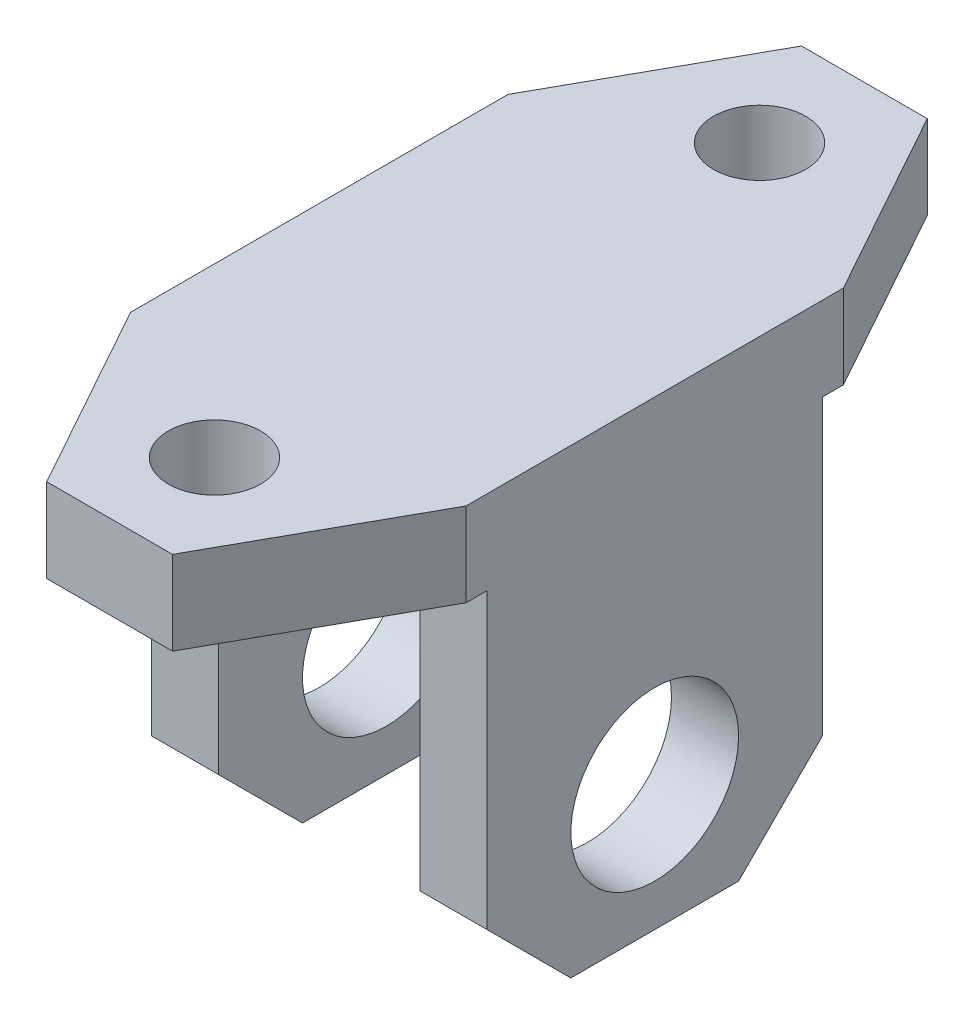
ISO-10303-21;
HEADER;
FILE_DESCRIPTION(('STEP AP214'),'2;1');
FILE_NAME('part.step','',(''),(''),'','','');
FILE_SCHEMA(('AUTOMOTIVE_DESIGN { 1 0 10303 214 1 1 1 1 }'));
ENDSEC;
DATA;
#1=APPLICATION_CONTEXT('core data for automotive mechanical design processes');
#2=APPLICATION_PROTOCOL_DEFINITION('international standard','automotive_design',2000,#1);
#3=PRODUCT_CONTEXT('',#1,'mechanical');
#4=PRODUCT('Part','Part','',(#3));
#5=PRODUCT_RELATED_PRODUCT_CATEGORY('part','',(#4));
#6=PRODUCT_DEFINITION_FORMATION('','',#4);
#7=PRODUCT_DEFINITION_CONTEXT('part definition',#1,'design');
#8=PRODUCT_DEFINITION('design','',#6,#7);
#9=PRODUCT_DEFINITION_SHAPE('','',#8);
#10=(LENGTH_UNIT() NAMED_UNIT(*) SI_UNIT(.MILLI.,.METRE.));
#11=(NAMED_UNIT(*) PLANE_ANGLE_UNIT() SI_UNIT($,.RADIAN.));
#12=(NAMED_UNIT(*) SI_UNIT($,.STERADIAN.) SOLID_ANGLE_UNIT());
#13=UNCERTAINTY_MEASURE_WITH_UNIT(LENGTH_MEASURE(1.E-05),#10,'distance_accuracy_value','');
#14=(GEOMETRIC_REPRESENTATION_CONTEXT(3) GLOBAL_UNCERTAINTY_ASSIGNED_CONTEXT((#13)) GLOBAL_UNIT_ASSIGNED_CONTEXT((#10,
#11,#12)) REPRESENTATION_CONTEXT('',''));
#15=CARTESIAN_POINT('',(0.,0.,0.));
#16=DIRECTION('',(0.,0.,1.));
#17=DIRECTION('',(1.,0.,0.));
#18=AXIS2_PLACEMENT_3D('',#15,#16,#17);
#19=CARTESIAN_POINT('',(2.4,-2.,-4.));
#20=DIRECTION('',(-1.,0.,0.));
#21=DIRECTION('',(0.,0.,1.));
#22=AXIS2_PLACEMENT_3D('',#19,#20,#21);
#23=PLANE('',#22);
#24=CARTESIAN_POINT('',(2.4,-8.,0.));
#25=DIRECTION('',(1.,0.,0.));
#26=DIRECTION('',(0.,0.,-1.));
#27=AXIS2_PLACEMENT_3D('',#24,#25,#26);
#28=CIRCLE('',#27,2.);
#29=CARTESIAN_POINT('',(2.4,-8.,-2.));
#30=VERTEX_POINT('',#29);
#31=EDGE_CURVE('E200',#30,#30,#28,.T.);
#32=ORIENTED_EDGE('',*,*,#31,.T.);
#33=EDGE_LOOP('',(#32));
#34=FACE_BOUND('',#33,.T.);
#35=DIRECTION('',(0.,0.,-1.));
#36=VECTOR('',#35,1.);
#37=CARTESIAN_POINT('',(2.4,-2.,-4.));
#38=LINE('',#37,#36);
#39=CARTESIAN_POINT('',(2.4,-2.,-4.));
#40=VERTEX_POINT('',#39);
#41=CARTESIAN_POINT('',(2.4,-2.,4.));
#42=VERTEX_POINT('',#41);
#43=EDGE_CURVE('E207',#40,#42,#38,.F.);
#44=ORIENTED_EDGE('',*,*,#43,.F.);
#45=DIRECTION('',(0.,1.,0.));
#46=VECTOR('',#45,1.);
#47=CARTESIAN_POINT('',(2.4,0.,-4.));
#48=LINE('',#47,#46);
#49=CARTESIAN_POINT('',(2.4,-9.,-4.));
#50=VERTEX_POINT('',#49);
#51=EDGE_CURVE('E209',#40,#50,#48,.F.);
#52=ORIENTED_EDGE('',*,*,#51,.T.);
#53=DIRECTION('',(0.,0.707106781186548,-0.707106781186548));
#54=VECTOR('',#53,1.);
#55=CARTESIAN_POINT('',(2.4,-9.,-4.));
#56=LINE('',#55,#54);
#57=CARTESIAN_POINT('',(2.4,-11.,-2.));
#58=VERTEX_POINT('',#57);
#59=EDGE_CURVE('E216',#58,#50,#56,.T.);
#60=ORIENTED_EDGE('',*,*,#59,.F.);
#61=DIRECTION('',(0.,0.,-1.));
#62=VECTOR('',#61,1.);
#63=CARTESIAN_POINT('',(2.4,-11.,-4.));
#64=LINE('',#63,#62);
#65=CARTESIAN_POINT('',(2.4,-11.,2.));
#66=VERTEX_POINT('',#65);
#67=EDGE_CURVE('E224',#66,#58,#64,.T.);
#68=ORIENTED_EDGE('',*,*,#67,.F.);
#69=DIRECTION('',(0.,0.707106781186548,0.707106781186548));
#70=VECTOR('',#69,1.);
#71=CARTESIAN_POINT('',(2.4,-9.,4.));
#72=LINE('',#71,#70);
#73=CARTESIAN_POINT('',(2.4,-9.,4.));
#74=VERTEX_POINT('',#73);
#75=EDGE_CURVE('E229',#66,#74,#72,.T.);
#76=ORIENTED_EDGE('',*,*,#75,.T.);
#77=DIRECTION('',(0.,1.,0.));
#78=VECTOR('',#77,1.);
#79=CARTESIAN_POINT('',(2.4,0.,4.));
#80=LINE('',#79,#78);
#81=EDGE_CURVE('E234',#42,#74,#80,.F.);
#82=ORIENTED_EDGE('',*,*,#81,.F.);
#83=EDGE_LOOP('',(#44,#52,#60,#68,#76,#82));
#84=FACE_BOUND('',#83,.T.);
#85=ADVANCED_FACE('F16',(#34,#84),#23,.T.);
#86=CARTESIAN_POINT('',(-2.4,-11.,-4.));
#87=DIRECTION('',(1.,0.,0.));
#88=DIRECTION('',(0.,0.,-1.));
#89=AXIS2_PLACEMENT_3D('',#86,#87,#88);
#90=PLANE('',#89);
#91=CARTESIAN_POINT('',(-2.4,-8.,0.));
#92=DIRECTION('',(1.,0.,0.));
#93=DIRECTION('',(0.,0.,-1.));
#94=AXIS2_PLACEMENT_3D('',#91,#92,#93);
#95=CIRCLE('',#94,2.);
#96=CARTESIAN_POINT('',(-2.4,-8.,-2.));
#97=VERTEX_POINT('',#96);
#98=EDGE_CURVE('E19',#97,#97,#95,.F.);
#99=ORIENTED_EDGE('',*,*,#98,.T.);
#100=EDGE_LOOP('',(#99));
#101=FACE_BOUND('',#100,.T.);
#102=DIRECTION('',(0.,0.707106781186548,-0.707106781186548));
#103=VECTOR('',#102,1.);
#104=CARTESIAN_POINT('',(-2.4,-9.,-4.));
#105=LINE('',#104,#103);
#106=CARTESIAN_POINT('',(-2.4,-9.,-4.));
#107=VERTEX_POINT('',#106);
#108=CARTESIAN_POINT('',(-2.4,-11.,-2.));
#109=VERTEX_POINT('',#108);
#110=EDGE_CURVE('E153',#107,#109,#105,.F.);
#111=ORIENTED_EDGE('',*,*,#110,.F.);
#112=DIRECTION('',(0.,1.,0.));
#113=VECTOR('',#112,1.);
#114=CARTESIAN_POINT('',(-2.4,0.,-4.));
#115=LINE('',#114,#113);
#116=CARTESIAN_POINT('',(-2.4,-2.,-4.));
#117=VERTEX_POINT('',#116);
#118=EDGE_CURVE('E157',#107,#117,#115,.T.);
#119=ORIENTED_EDGE('',*,*,#118,.T.);
#120=DIRECTION('',(0.,0.,-1.));
#121=VECTOR('',#120,1.);
#122=CARTESIAN_POINT('',(-2.4,-2.,-4.));
#123=LINE('',#122,#121);
#124=CARTESIAN_POINT('',(-2.4,-2.,4.));
#125=VERTEX_POINT('',#124);
#126=EDGE_CURVE('E272',#125,#117,#123,.T.);
#127=ORIENTED_EDGE('',*,*,#126,.F.);
#128=DIRECTION('',(0.,1.,0.));
#129=VECTOR('',#128,1.);
#130=CARTESIAN_POINT('',(-2.4,0.,4.));
#131=LINE('',#130,#129);
#132=CARTESIAN_POINT('',(-2.4,-9.,4.));
#133=VERTEX_POINT('',#132);
#134=EDGE_CURVE('E236',#133,#125,#131,.T.);
#135=ORIENTED_EDGE('',*,*,#134,.F.);
#136=DIRECTION('',(0.,0.707106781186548,0.707106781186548));
#137=VECTOR('',#136,1.);
#138=CARTESIAN_POINT('',(-2.4,-9.,4.));
#139=LINE('',#138,#137);
#140=CARTESIAN_POINT('',(-2.4,-11.,2.));
#141=VERTEX_POINT('',#140);
#142=EDGE_CURVE('E243',#133,#141,#139,.F.);
#143=ORIENTED_EDGE('',*,*,#142,.T.);
#144=DIRECTION('',(0.,0.,-1.));
#145=VECTOR('',#144,1.);
#146=CARTESIAN_POINT('',(-2.4,-11.,-4.));
#147=LINE('',#146,#145);
#148=EDGE_CURVE('E151',#109,#141,#147,.F.);
#149=ORIENTED_EDGE('',*,*,#148,.F.);
#150=EDGE_LOOP('',(#111,#119,#127,#135,#143,#149));
#151=FACE_BOUND('',#150,.T.);
#152=ADVANCED_FACE('F155',(#101,#151),#90,.T.);
#153=CARTESIAN_POINT('',(0.,0.,-4.));
#154=DIRECTION('',(0.,0.,1.));
#155=DIRECTION('',(1.,0.,0.));
#156=AXIS2_PLACEMENT_3D('',#153,#154,#155);
#157=PLANE('',#156);
#158=DIRECTION('',(1.,0.,0.));
#159=VECTOR('',#158,1.);
#160=CARTESIAN_POINT('',(-4.,-9.,-4.));
#161=LINE('',#160,#159);
#162=CARTESIAN_POINT('',(-4.,-9.,-4.));
#163=VERTEX_POINT('',#162);
#164=EDGE_CURVE('E162',#163,#107,#161,.T.);
#165=ORIENTED_EDGE('',*,*,#164,.F.);
#166=DIRECTION('',(0.,1.,0.));
#167=VECTOR('',#166,1.);
#168=CARTESIAN_POINT('',(-4.,0.,-4.));
#169=LINE('',#168,#167);
#170=CARTESIAN_POINT('',(-4.,-2.,-4.));
#171=VERTEX_POINT('',#170);
#172=EDGE_CURVE('E258',#171,#163,#169,.F.);
#173=ORIENTED_EDGE('',*,*,#172,.F.);
#174=DIRECTION('',(1.,0.,0.));
#175=VECTOR('',#174,1.);
#176=CARTESIAN_POINT('',(-2.4,-2.,-4.));
#177=LINE('',#176,#175);
#178=EDGE_CURVE('E168',#117,#171,#177,.F.);
#179=ORIENTED_EDGE('',*,*,#178,.F.);
#180=ORIENTED_EDGE('',*,*,#118,.F.);
#181=EDGE_LOOP('',(#165,#173,#179,#180));
#182=FACE_BOUND('',#181,.T.);
#183=ADVANCED_FACE('F165',(#182),#157,.F.);
#184=CARTESIAN_POINT('',(-4.,-9.,-4.));
#185=DIRECTION('',(0.,-0.707106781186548,-0.707106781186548));
#186=DIRECTION('',(0.,0.707106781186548,-0.707106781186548));
#187=AXIS2_PLACEMENT_3D('',#184,#185,#186);
#188=PLANE('',#187);
#189=DIRECTION('',(0.,-0.707106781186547,0.707106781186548));
#190=VECTOR('',#189,1.);
#191=CARTESIAN_POINT('',(-4.,-9.,-4.));
#192=LINE('',#191,#190);
#193=CARTESIAN_POINT('',(-4.,-11.,-2.));
#194=VERTEX_POINT('',#193);
#195=EDGE_CURVE('E173',#163,#194,#192,.T.);
#196=ORIENTED_EDGE('',*,*,#195,.F.);
#197=ORIENTED_EDGE('',*,*,#164,.T.);
#198=ORIENTED_EDGE('',*,*,#110,.T.);
#199=DIRECTION('',(1.,0.,0.));
#200=VECTOR('',#199,1.);
#201=CARTESIAN_POINT('',(-4.,-11.,-2.));
#202=LINE('',#201,#200);
#203=EDGE_CURVE('E176',#194,#109,#202,.T.);
#204=ORIENTED_EDGE('',*,*,#203,.F.);
#205=EDGE_LOOP('',(#196,#197,#198,#204));
#206=FACE_BOUND('',#205,.T.);
#207=ADVANCED_FACE('F171',(#206),#188,.T.);
#208=CARTESIAN_POINT('',(-4.,-11.,-4.));
#209=DIRECTION('',(0.,-1.,0.));
#210=DIRECTION('',(0.,0.,-1.));
#211=AXIS2_PLACEMENT_3D('',#208,#209,#210);
#212=PLANE('',#211);
#213=DIRECTION('',(0.,0.,1.));
#214=VECTOR('',#213,1.);
#215=CARTESIAN_POINT('',(-4.,-11.,-4.));
#216=LINE('',#215,#214);
#217=CARTESIAN_POINT('',(-4.,-11.,2.));
#218=VERTEX_POINT('',#217);
#219=EDGE_CURVE('E249',#194,#218,#216,.T.);
#220=ORIENTED_EDGE('',*,*,#219,.F.);
#221=ORIENTED_EDGE('',*,*,#203,.T.);
#222=ORIENTED_EDGE('',*,*,#148,.T.);
#223=DIRECTION('',(1.,0.,0.));
#224=VECTOR('',#223,1.);
#225=CARTESIAN_POINT('',(-4.,-11.,2.));
#226=LINE('',#225,#224);
#227=EDGE_CURVE('E241',#141,#218,#226,.F.);
#228=ORIENTED_EDGE('',*,*,#227,.T.);
#229=EDGE_LOOP('',(#220,#221,#222,#228));
#230=FACE_BOUND('',#229,.T.);
#231=ADVANCED_FACE('F246',(#230),#212,.T.);
#232=CARTESIAN_POINT('',(-4.,-9.,4.));
#233=DIRECTION('',(0.,0.707106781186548,-0.707106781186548));
#234=DIRECTION('',(0.,0.707106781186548,0.707106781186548));
#235=AXIS2_PLACEMENT_3D('',#232,#233,#234);
#236=PLANE('',#235);
#237=ORIENTED_EDGE('',*,*,#227,.F.);
#238=ORIENTED_EDGE('',*,*,#142,.F.);
#239=DIRECTION('',(1.,0.,0.));
#240=VECTOR('',#239,1.);
#241=CARTESIAN_POINT('',(0.,-9.,4.));
#242=LINE('',#241,#240);
#243=CARTESIAN_POINT('',(-4.,-9.,4.));
#244=VERTEX_POINT('',#243);
#245=EDGE_CURVE('E238',#244,#133,#242,.T.);
#246=ORIENTED_EDGE('',*,*,#245,.F.);
#247=DIRECTION('',(0.,0.707106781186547,0.707106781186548));
#248=VECTOR('',#247,1.);
#249=CARTESIAN_POINT('',(-4.,-11.,2.));
#250=LINE('',#249,#248);
#251=EDGE_CURVE('E253',#218,#244,#250,.T.);
#252=ORIENTED_EDGE('',*,*,#251,.F.);
#253=EDGE_LOOP('',(#237,#238,#246,#252));
#254=FACE_BOUND('',#253,.T.);
#255=ADVANCED_FACE('F329',(#254),#236,.F.);
#256=CARTESIAN_POINT('',(0.,0.,4.));
#257=DIRECTION('',(0.,0.,1.));
#258=DIRECTION('',(1.,0.,0.));
#259=AXIS2_PLACEMENT_3D('',#256,#257,#258);
#260=PLANE('',#259);
#261=ORIENTED_EDGE('',*,*,#134,.T.);
#262=DIRECTION('',(1.,0.,0.));
#263=VECTOR('',#262,1.);
#264=CARTESIAN_POINT('',(-2.4,-2.,4.));
#265=LINE('',#264,#263);
#266=CARTESIAN_POINT('',(-4.,-2.,4.));
#267=VERTEX_POINT('',#266);
#268=EDGE_CURVE('E274',#267,#125,#265,.T.);
#269=ORIENTED_EDGE('',*,*,#268,.F.);
#270=DIRECTION('',(0.,1.,0.));
#271=VECTOR('',#270,1.);
#272=CARTESIAN_POINT('',(-4.,0.,4.));
#273=LINE('',#272,#271);
#274=EDGE_CURVE('E325',#244,#267,#273,.T.);
#275=ORIENTED_EDGE('',*,*,#274,.F.);
#276=ORIENTED_EDGE('',*,*,#245,.T.);
#277=EDGE_LOOP('',(#261,#269,#275,#276));
#278=FACE_BOUND('',#277,.T.);
#279=ADVANCED_FACE('F332',(#278),#260,.T.);
#280=CARTESIAN_POINT('',(4.,-8.,0.));
#281=DIRECTION('',(1.,0.,0.));
#282=DIRECTION('',(0.,0.,-1.));
#283=AXIS2_PLACEMENT_3D('',#280,#281,#282);
#284=CYLINDRICAL_SURFACE('',#283,2.);
#285=ORIENTED_EDGE('',*,*,#98,.F.);
#286=EDGE_LOOP('',(#285));
#287=FACE_BOUND('',#286,.T.);
#288=CARTESIAN_POINT('',(-4.,-8.,0.));
#289=DIRECTION('',(1.,0.,0.));
#290=DIRECTION('',(0.,0.,-1.));
#291=AXIS2_PLACEMENT_3D('',#288,#289,#290);
#292=CIRCLE('',#291,2.);
#293=CARTESIAN_POINT('',(-4.,-8.,-2.));
#294=VERTEX_POINT('',#293);
#295=EDGE_CURVE('E196',#294,#294,#292,.T.);
#296=ORIENTED_EDGE('',*,*,#295,.F.);
#297=EDGE_LOOP('',(#296));
#298=FACE_BOUND('',#297,.T.);
#299=ADVANCED_FACE('F552',(#287,#298),#284,.F.);
#300=CARTESIAN_POINT('',(0.,0.,4.));
#301=DIRECTION('',(0.,0.,1.));
#302=DIRECTION('',(1.,0.,0.));
#303=AXIS2_PLACEMENT_3D('',#300,#301,#302);
#304=PLANE('',#303);
#305=DIRECTION('',(0.,1.,0.));
#306=VECTOR('',#305,1.);
#307=CARTESIAN_POINT('',(4.,-11.,4.));
#308=LINE('',#307,#306);
#309=CARTESIAN_POINT('',(4.,-2.,4.));
#310=VERTEX_POINT('',#309);
#311=CARTESIAN_POINT('',(4.,-9.,4.));
#312=VERTEX_POINT('',#311);
#313=EDGE_CURVE('E293',#310,#312,#308,.F.);
#314=ORIENTED_EDGE('',*,*,#313,.F.);
#315=DIRECTION('',(1.,0.,0.));
#316=VECTOR('',#315,1.);
#317=CARTESIAN_POINT('',(-2.4,-2.,4.));
#318=LINE('',#317,#316);
#319=EDGE_CURVE('E277',#42,#310,#318,.T.);
#320=ORIENTED_EDGE('',*,*,#319,.F.);
#321=ORIENTED_EDGE('',*,*,#81,.T.);
#322=DIRECTION('',(1.,0.,0.));
#323=VECTOR('',#322,1.);
#324=CARTESIAN_POINT('',(2.4,-9.,4.));
#325=LINE('',#324,#323);
#326=EDGE_CURVE('E232',#74,#312,#325,.T.);
#327=ORIENTED_EDGE('',*,*,#326,.T.);
#328=EDGE_LOOP('',(#314,#320,#321,#327));
#329=FACE_BOUND('',#328,.T.);
#330=ADVANCED_FACE('F291',(#329),#304,.T.);
#331=CARTESIAN_POINT('',(2.4,-9.,4.));
#332=DIRECTION('',(0.,0.707106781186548,-0.707106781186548));
#333=DIRECTION('',(0.,0.707106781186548,0.707106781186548));
#334=AXIS2_PLACEMENT_3D('',#331,#332,#333);
#335=PLANE('',#334);
#336=DIRECTION('',(1.,0.,0.));
#337=VECTOR('',#336,1.);
#338=CARTESIAN_POINT('',(2.4,-11.,2.));
#339=LINE('',#338,#337);
#340=CARTESIAN_POINT('',(4.,-11.,2.));
#341=VERTEX_POINT('',#340);
#342=EDGE_CURVE('E226',#341,#66,#339,.F.);
#343=ORIENTED_EDGE('',*,*,#342,.F.);
#344=DIRECTION('',(0.,-0.707106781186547,-0.707106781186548));
#345=VECTOR('',#344,1.);
#346=CARTESIAN_POINT('',(4.,-9.,4.));
#347=LINE('',#346,#345);
#348=EDGE_CURVE('E297',#312,#341,#347,.T.);
#349=ORIENTED_EDGE('',*,*,#348,.F.);
#350=ORIENTED_EDGE('',*,*,#326,.F.);
#351=ORIENTED_EDGE('',*,*,#75,.F.);
#352=EDGE_LOOP('',(#343,#349,#350,#351));
#353=FACE_BOUND('',#352,.T.);
#354=ADVANCED_FACE('F374',(#353),#335,.F.);
#355=CARTESIAN_POINT('',(2.4,-11.,-4.));
#356=DIRECTION('',(0.,-1.,0.));
#357=DIRECTION('',(0.,0.,-1.));
#358=AXIS2_PLACEMENT_3D('',#355,#356,#357);
#359=PLANE('',#358);
#360=ORIENTED_EDGE('',*,*,#67,.T.);
#361=DIRECTION('',(1.,0.,0.));
#362=VECTOR('',#361,1.);
#363=CARTESIAN_POINT('',(2.4,-11.,-2.));
#364=LINE('',#363,#362);
#365=CARTESIAN_POINT('',(4.,-11.,-2.));
#366=VERTEX_POINT('',#365);
#367=EDGE_CURVE('E221',#366,#58,#364,.F.);
#368=ORIENTED_EDGE('',*,*,#367,.F.);
#369=DIRECTION('',(0.,0.,-1.));
#370=VECTOR('',#369,1.);
#371=CARTESIAN_POINT('',(4.,-11.,-4.));
#372=LINE('',#371,#370);
#373=EDGE_CURVE('E370',#341,#366,#372,.T.);
#374=ORIENTED_EDGE('',*,*,#373,.F.);
#375=ORIENTED_EDGE('',*,*,#342,.T.);
#376=EDGE_LOOP('',(#360,#368,#374,#375));
#377=FACE_BOUND('',#376,.T.);
#378=ADVANCED_FACE('F376',(#377),#359,.T.);
#379=CARTESIAN_POINT('',(2.4,-9.,-4.));
#380=DIRECTION('',(0.,-0.707106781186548,-0.707106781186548));
#381=DIRECTION('',(0.,0.707106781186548,-0.707106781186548));
#382=AXIS2_PLACEMENT_3D('',#379,#380,#381);
#383=PLANE('',#382);
#384=ORIENTED_EDGE('',*,*,#59,.T.);
#385=DIRECTION('',(1.,0.,0.));
#386=VECTOR('',#385,1.);
#387=CARTESIAN_POINT('',(0.,-9.,-4.));
#388=LINE('',#387,#386);
#389=CARTESIAN_POINT('',(4.,-9.,-4.));
#390=VERTEX_POINT('',#389);
#391=EDGE_CURVE('E203',#50,#390,#388,.T.);
#392=ORIENTED_EDGE('',*,*,#391,.T.);
#393=DIRECTION('',(0.,0.707106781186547,-0.707106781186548));
#394=VECTOR('',#393,1.);
#395=CARTESIAN_POINT('',(4.,-11.,-2.));
#396=LINE('',#395,#394);
#397=EDGE_CURVE('E367',#366,#390,#396,.T.);
#398=ORIENTED_EDGE('',*,*,#397,.F.);
#399=ORIENTED_EDGE('',*,*,#367,.T.);
#400=EDGE_LOOP('',(#384,#392,#398,#399));
#401=FACE_BOUND('',#400,.T.);
#402=ADVANCED_FACE('F377',(#401),#383,.T.);
#403=CARTESIAN_POINT('',(0.,0.,-4.));
#404=DIRECTION('',(0.,0.,1.));
#405=DIRECTION('',(1.,0.,0.));
#406=AXIS2_PLACEMENT_3D('',#403,#404,#405);
#407=PLANE('',#406);
#408=ORIENTED_EDGE('',*,*,#391,.F.);
#409=ORIENTED_EDGE('',*,*,#51,.F.);
#410=DIRECTION('',(1.,0.,0.));
#411=VECTOR('',#410,1.);
#412=CARTESIAN_POINT('',(-2.4,-2.,-4.));
#413=LINE('',#412,#411);
#414=CARTESIAN_POINT('',(4.,-2.,-4.));
#415=VERTEX_POINT('',#414);
#416=EDGE_CURVE('E202',#415,#40,#413,.F.);
#417=ORIENTED_EDGE('',*,*,#416,.F.);
#418=DIRECTION('',(0.,1.,0.));
#419=VECTOR('',#418,1.);
#420=CARTESIAN_POINT('',(4.,-11.,-4.));
#421=LINE('',#420,#419);
#422=EDGE_CURVE('E364',#390,#415,#421,.T.);
#423=ORIENTED_EDGE('',*,*,#422,.F.);
#424=EDGE_LOOP('',(#408,#409,#417,#423));
#425=FACE_BOUND('',#424,.T.);
#426=ADVANCED_FACE('F379',(#425),#407,.F.);
#427=CARTESIAN_POINT('',(4.,-8.,0.));
#428=DIRECTION('',(1.,0.,0.));
#429=DIRECTION('',(0.,0.,-1.));
#430=AXIS2_PLACEMENT_3D('',#427,#428,#429);
#431=CYLINDRICAL_SURFACE('',#430,2.);
#432=CARTESIAN_POINT('',(4.,-8.,0.));
#433=DIRECTION('',(1.,0.,0.));
#434=DIRECTION('',(0.,0.,-1.));
#435=AXIS2_PLACEMENT_3D('',#432,#433,#434);
#436=CIRCLE('',#435,2.);
#437=CARTESIAN_POINT('',(4.,-8.,-2.));
#438=VERTEX_POINT('',#437);
#439=EDGE_CURVE('E191',#438,#438,#436,.F.);
#440=ORIENTED_EDGE('',*,*,#439,.F.);
#441=EDGE_LOOP('',(#440));
#442=FACE_BOUND('',#441,.T.);
#443=ORIENTED_EDGE('',*,*,#31,.F.);
#444=EDGE_LOOP('',(#443));
#445=FACE_BOUND('',#444,.T.);
#446=ADVANCED_FACE('F507',(#442,#445),#431,.F.);
#447=CARTESIAN_POINT('',(-2.4,-2.,-4.));
#448=DIRECTION('',(0.,-1.,0.));
#449=DIRECTION('',(0.,0.,-1.));
#450=AXIS2_PLACEMENT_3D('',#447,#448,#449);
#451=PLANE('',#450);
#452=CARTESIAN_POINT('',(0.,-2.,-6.5));
#453=DIRECTION('',(0.,1.,0.));
#454=DIRECTION('',(0.,0.,1.));
#455=AXIS2_PLACEMENT_3D('',#452,#453,#454);
#456=CIRCLE('',#455,1.1);
#457=CARTESIAN_POINT('',(0.,-2.,-5.4));
#458=VERTEX_POINT('',#457);
#459=EDGE_CURVE('E183',#458,#458,#456,.T.);
#460=ORIENTED_EDGE('',*,*,#459,.T.);
#461=EDGE_LOOP('',(#460));
#462=FACE_BOUND('',#461,.T.);
#463=CARTESIAN_POINT('',(0.,-2.,6.5));
#464=DIRECTION('',(0.,-1.,0.));
#465=DIRECTION('',(0.,0.,-1.));
#466=AXIS2_PLACEMENT_3D('',#463,#464,#465);
#467=CIRCLE('',#466,1.1);
#468=CARTESIAN_POINT('',(0.,-2.,5.4));
#469=VERTEX_POINT('',#468);
#470=EDGE_CURVE('E187',#469,#469,#467,.F.);
#471=ORIENTED_EDGE('',*,*,#470,.T.);
#472=EDGE_LOOP('',(#471));
#473=FACE_BOUND('',#472,.T.);
#474=DIRECTION('',(1.,0.,0.));
#475=VECTOR('',#474,1.);
#476=CARTESIAN_POINT('',(0.,-2.,-9.));
#477=LINE('',#476,#475);
#478=CARTESIAN_POINT('',(-1.50000000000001,-2.,-9.00000000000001));
#479=VERTEX_POINT('',#478);
#480=CARTESIAN_POINT('',(1.5,-2.,-9.));
#481=VERTEX_POINT('',#480);
#482=EDGE_CURVE('E269',#479,#481,#477,.T.);
#483=ORIENTED_EDGE('',*,*,#482,.T.);
#484=DIRECTION('',(0.485642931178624,0.,0.874157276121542));
#485=VECTOR('',#484,1.);
#486=CARTESIAN_POINT('',(1.5,-2.,-9.));
#487=LINE('',#486,#485);
#488=CARTESIAN_POINT('',(3.99999999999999,-2.,-4.5));
#489=VERTEX_POINT('',#488);
#490=EDGE_CURVE('E194',#481,#489,#487,.T.);
#491=ORIENTED_EDGE('',*,*,#490,.T.);
#492=DIRECTION('',(0.,0.,-1.));
#493=VECTOR('',#492,1.);
#494=CARTESIAN_POINT('',(4.,-2.,-4.));
#495=LINE('',#494,#493);
#496=EDGE_CURVE('E195',#415,#489,#495,.T.);
#497=ORIENTED_EDGE('',*,*,#496,.F.);
#498=ORIENTED_EDGE('',*,*,#416,.T.);
#499=ORIENTED_EDGE('',*,*,#43,.T.);
#500=ORIENTED_EDGE('',*,*,#319,.T.);
#501=DIRECTION('',(0.,0.,-1.));
#502=VECTOR('',#501,1.);
#503=CARTESIAN_POINT('',(4.,-2.,-4.));
#504=LINE('',#503,#502);
#505=CARTESIAN_POINT('',(4.,-2.,4.5));
#506=VERTEX_POINT('',#505);
#507=EDGE_CURVE('E298',#506,#310,#504,.T.);
#508=ORIENTED_EDGE('',*,*,#507,.F.);
#509=DIRECTION('',(-0.485642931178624,0.,0.874157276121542));
#510=VECTOR('',#509,1.);
#511=CARTESIAN_POINT('',(4.,-2.,4.5));
#512=LINE('',#511,#510);
#513=CARTESIAN_POINT('',(1.50000000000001,-2.,9.00000000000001));
#514=VERTEX_POINT('',#513);
#515=EDGE_CURVE('E309',#506,#514,#512,.T.);
#516=ORIENTED_EDGE('',*,*,#515,.T.);
#517=DIRECTION('',(1.,0.,0.));
#518=VECTOR('',#517,1.);
#519=CARTESIAN_POINT('',(0.,-2.,9.));
#520=LINE('',#519,#518);
#521=CARTESIAN_POINT('',(-1.5,-2.,9.));
#522=VERTEX_POINT('',#521);
#523=EDGE_CURVE('E314',#522,#514,#520,.T.);
#524=ORIENTED_EDGE('',*,*,#523,.F.);
#525=DIRECTION('',(-0.485642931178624,0.,-0.874157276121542));
#526=VECTOR('',#525,1.);
#527=CARTESIAN_POINT('',(-1.5,-2.,9.));
#528=LINE('',#527,#526);
#529=CARTESIAN_POINT('',(-3.99999999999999,-2.,4.49999999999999));
#530=VERTEX_POINT('',#529);
#531=EDGE_CURVE('E198',#522,#530,#528,.T.);
#532=ORIENTED_EDGE('',*,*,#531,.T.);
#533=DIRECTION('',(0.,0.,1.));
#534=VECTOR('',#533,1.);
#535=CARTESIAN_POINT('',(-4.,-2.,-4.));
#536=LINE('',#535,#534);
#537=EDGE_CURVE('E322',#267,#530,#536,.T.);
#538=ORIENTED_EDGE('',*,*,#537,.F.);
#539=ORIENTED_EDGE('',*,*,#268,.T.);
#540=ORIENTED_EDGE('',*,*,#126,.T.);
#541=ORIENTED_EDGE('',*,*,#178,.T.);
#542=DIRECTION('',(0.,0.,1.));
#543=VECTOR('',#542,1.);
#544=CARTESIAN_POINT('',(-4.,-2.,-4.));
#545=LINE('',#544,#543);
#546=CARTESIAN_POINT('',(-4.,-2.,-4.5));
#547=VERTEX_POINT('',#546);
#548=EDGE_CURVE('E260',#547,#171,#545,.T.);
#549=ORIENTED_EDGE('',*,*,#548,.F.);
#550=DIRECTION('',(0.485642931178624,0.,-0.874157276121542));
#551=VECTOR('',#550,1.);
#552=CARTESIAN_POINT('',(-4.,-2.,-4.5));
#553=LINE('',#552,#551);
#554=EDGE_CURVE('E267',#547,#479,#553,.T.);
#555=ORIENTED_EDGE('',*,*,#554,.T.);
#556=EDGE_LOOP('',(#483,#491,#497,#498,#499,#500,#508,#516,#524,#532,#538,#539,#540,#541,#549,#555));
#557=FACE_BOUND('',#556,.T.);
#558=ADVANCED_FACE('F281',(#462,#473,#557),#451,.T.);
#559=CARTESIAN_POINT('',(0.,0.,-9.));
#560=DIRECTION('',(0.,0.,1.));
#561=DIRECTION('',(1.,0.,0.));
#562=AXIS2_PLACEMENT_3D('',#559,#560,#561);
#563=PLANE('',#562);
#564=DIRECTION('',(0.,1.,0.));
#565=VECTOR('',#564,1.);
#566=CARTESIAN_POINT('',(-1.50000000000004,0.,-9.00000000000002));
#567=LINE('',#566,#565);
#568=CARTESIAN_POINT('',(-1.50000000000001,0.,-9.00000000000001));
#569=VERTEX_POINT('',#568);
#570=EDGE_CURVE('E265',#479,#569,#567,.T.);
#571=ORIENTED_EDGE('',*,*,#570,.T.);
#572=DIRECTION('',(1.,0.,0.));
#573=VECTOR('',#572,1.);
#574=CARTESIAN_POINT('',(4.,0.,-9.));
#575=LINE('',#574,#573);
#576=CARTESIAN_POINT('',(1.5,0.,-9.));
#577=VERTEX_POINT('',#576);
#578=EDGE_CURVE('E186',#577,#569,#575,.F.);
#579=ORIENTED_EDGE('',*,*,#578,.F.);
#580=DIRECTION('',(0.,1.,0.));
#581=VECTOR('',#580,1.);
#582=CARTESIAN_POINT('',(1.5,0.,-9.));
#583=LINE('',#582,#581);
#584=EDGE_CURVE('E190',#577,#481,#583,.F.);
#585=ORIENTED_EDGE('',*,*,#584,.T.);
#586=ORIENTED_EDGE('',*,*,#482,.F.);
#587=EDGE_LOOP('',(#571,#579,#585,#586));
#588=FACE_BOUND('',#587,.T.);
#589=ADVANCED_FACE('F490',(#588),#563,.F.);
#590=CARTESIAN_POINT('',(-4.,0.,-4.5));
#591=DIRECTION('',(0.874157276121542,0.,0.485642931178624));
#592=DIRECTION('',(0.485642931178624,0.,-0.874157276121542));
#593=AXIS2_PLACEMENT_3D('',#590,#591,#592);
#594=PLANE('',#593);
#595=DIRECTION('',(-0.485642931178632,0.,0.874157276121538));
#596=VECTOR('',#595,1.);
#597=CARTESIAN_POINT('',(-1.5,0.,-9.));
#598=LINE('',#597,#596);
#599=CARTESIAN_POINT('',(-4.,0.,-4.5));
#600=VERTEX_POINT('',#599);
#601=EDGE_CURVE('E353',#569,#600,#598,.T.);
#602=ORIENTED_EDGE('',*,*,#601,.F.);
#603=ORIENTED_EDGE('',*,*,#570,.F.);
#604=ORIENTED_EDGE('',*,*,#554,.F.);
#605=DIRECTION('',(0.,1.,0.));
#606=VECTOR('',#605,1.);
#607=CARTESIAN_POINT('',(-4.,0.,-4.5));
#608=LINE('',#607,#606);
#609=EDGE_CURVE('E199',#600,#547,#608,.F.);
#610=ORIENTED_EDGE('',*,*,#609,.F.);
#611=EDGE_LOOP('',(#602,#603,#604,#610));
#612=FACE_BOUND('',#611,.T.);
#613=ADVANCED_FACE('F481',(#612),#594,.F.);
#614=CARTESIAN_POINT('',(-4.,0.,-4.));
#615=DIRECTION('',(-1.,0.,0.));
#616=DIRECTION('',(0.,0.,1.));
#617=AXIS2_PLACEMENT_3D('',#614,#615,#616);
#618=PLANE('',#617);
#619=ORIENTED_EDGE('',*,*,#295,.T.);
#620=EDGE_LOOP('',(#619));
#621=FACE_BOUND('',#620,.T.);
#622=DIRECTION('',(0.,0.,1.));
#623=VECTOR('',#622,1.);
#624=CARTESIAN_POINT('',(-4.,0.,-4.));
#625=LINE('',#624,#623);
#626=CARTESIAN_POINT('',(-3.99999999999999,0.,4.49999999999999));
#627=VERTEX_POINT('',#626);
#628=EDGE_CURVE('E346',#600,#627,#625,.T.);
#629=ORIENTED_EDGE('',*,*,#628,.F.);
#630=ORIENTED_EDGE('',*,*,#609,.T.);
#631=ORIENTED_EDGE('',*,*,#548,.T.);
#632=ORIENTED_EDGE('',*,*,#172,.T.);
#633=ORIENTED_EDGE('',*,*,#195,.T.);
#634=ORIENTED_EDGE('',*,*,#219,.T.);
#635=ORIENTED_EDGE('',*,*,#251,.T.);
#636=ORIENTED_EDGE('',*,*,#274,.T.);
#637=ORIENTED_EDGE('',*,*,#537,.T.);
#638=DIRECTION('',(0.,1.,0.));
#639=VECTOR('',#638,1.);
#640=CARTESIAN_POINT('',(-3.99999999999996,0.,4.49999999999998));
#641=LINE('',#640,#639);
#642=EDGE_CURVE('E317',#530,#627,#641,.T.);
#643=ORIENTED_EDGE('',*,*,#642,.T.);
#644=EDGE_LOOP('',(#629,#630,#631,#632,#633,#634,#635,#636,#637,#643));
#645=FACE_BOUND('',#644,.T.);
#646=ADVANCED_FACE('F256',(#621,#645),#618,.T.);
#647=CARTESIAN_POINT('',(-1.5,0.,9.));
#648=DIRECTION('',(0.874157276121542,0.,-0.485642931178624));
#649=DIRECTION('',(-0.485642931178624,0.,-0.874157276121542));
#650=AXIS2_PLACEMENT_3D('',#647,#648,#649);
#651=PLANE('',#650);
#652=DIRECTION('',(0.485642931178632,0.,0.874157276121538));
#653=VECTOR('',#652,1.);
#654=CARTESIAN_POINT('',(-4.,0.,4.5));
#655=LINE('',#654,#653);
#656=CARTESIAN_POINT('',(-1.5,0.,9.));
#657=VERTEX_POINT('',#656);
#658=EDGE_CURVE('E340',#627,#657,#655,.T.);
#659=ORIENTED_EDGE('',*,*,#658,.F.);
#660=ORIENTED_EDGE('',*,*,#642,.F.);
#661=ORIENTED_EDGE('',*,*,#531,.F.);
#662=DIRECTION('',(0.,1.,0.));
#663=VECTOR('',#662,1.);
#664=CARTESIAN_POINT('',(-1.5,0.,9.));
#665=LINE('',#664,#663);
#666=EDGE_CURVE('E311',#657,#522,#665,.F.);
#667=ORIENTED_EDGE('',*,*,#666,.F.);
#668=EDGE_LOOP('',(#659,#660,#661,#667));
#669=FACE_BOUND('',#668,.T.);
#670=ADVANCED_FACE('F338',(#669),#651,.F.);
#671=CARTESIAN_POINT('',(0.,0.,9.));
#672=DIRECTION('',(0.,0.,1.));
#673=DIRECTION('',(1.,0.,0.));
#674=AXIS2_PLACEMENT_3D('',#671,#672,#673);
#675=PLANE('',#674);
#676=DIRECTION('',(1.,0.,0.));
#677=VECTOR('',#676,1.);
#678=CARTESIAN_POINT('',(4.,0.,9.));
#679=LINE('',#678,#677);
#680=CARTESIAN_POINT('',(1.50000000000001,0.,9.00000000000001));
#681=VERTEX_POINT('',#680);
#682=EDGE_CURVE('E345',#657,#681,#679,.T.);
#683=ORIENTED_EDGE('',*,*,#682,.F.);
#684=ORIENTED_EDGE('',*,*,#666,.T.);
#685=ORIENTED_EDGE('',*,*,#523,.T.);
#686=DIRECTION('',(0.,1.,0.));
#687=VECTOR('',#686,1.);
#688=CARTESIAN_POINT('',(1.50000000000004,0.,9.00000000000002));
#689=LINE('',#688,#687);
#690=EDGE_CURVE('E304',#514,#681,#689,.T.);
#691=ORIENTED_EDGE('',*,*,#690,.T.);
#692=EDGE_LOOP('',(#683,#684,#685,#691));
#693=FACE_BOUND('',#692,.T.);
#694=ADVANCED_FACE('F394',(#693),#675,.T.);
#695=CARTESIAN_POINT('',(4.,0.,4.5));
#696=DIRECTION('',(-0.874157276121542,0.,-0.485642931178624));
#697=DIRECTION('',(-0.485642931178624,0.,0.874157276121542));
#698=AXIS2_PLACEMENT_3D('',#695,#696,#697);
#699=PLANE('',#698);
#700=DIRECTION('',(0.485642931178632,0.,-0.874157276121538));
#701=VECTOR('',#700,1.);
#702=CARTESIAN_POINT('',(1.5,0.,9.));
#703=LINE('',#702,#701);
#704=CARTESIAN_POINT('',(4.,0.,4.5));
#705=VERTEX_POINT('',#704);
#706=EDGE_CURVE('E390',#681,#705,#703,.T.);
#707=ORIENTED_EDGE('',*,*,#706,.F.);
#708=ORIENTED_EDGE('',*,*,#690,.F.);
#709=ORIENTED_EDGE('',*,*,#515,.F.);
#710=DIRECTION('',(0.,1.,0.));
#711=VECTOR('',#710,1.);
#712=CARTESIAN_POINT('',(4.,-11.,4.5));
#713=LINE('',#712,#711);
#714=EDGE_CURVE('E302',#705,#506,#713,.F.);
#715=ORIENTED_EDGE('',*,*,#714,.F.);
#716=EDGE_LOOP('',(#707,#708,#709,#715));
#717=FACE_BOUND('',#716,.T.);
#718=ADVANCED_FACE('F397',(#717),#699,.F.);
#719=CARTESIAN_POINT('',(4.,-11.,-4.));
#720=DIRECTION('',(1.,0.,0.));
#721=DIRECTION('',(0.,0.,-1.));
#722=AXIS2_PLACEMENT_3D('',#719,#720,#721);
#723=PLANE('',#722);
#724=ORIENTED_EDGE('',*,*,#439,.T.);
#725=EDGE_LOOP('',(#724));
#726=FACE_BOUND('',#725,.T.);
#727=ORIENTED_EDGE('',*,*,#496,.T.);
#728=DIRECTION('',(0.,1.,0.));
#729=VECTOR('',#728,1.);
#730=CARTESIAN_POINT('',(3.99999999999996,0.,-4.49999999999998));
#731=LINE('',#730,#729);
#732=CARTESIAN_POINT('',(3.99999999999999,0.,-4.49999999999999));
#733=VERTEX_POINT('',#732);
#734=EDGE_CURVE('E34',#489,#733,#731,.T.);
#735=ORIENTED_EDGE('',*,*,#734,.T.);
#736=DIRECTION('',(0.,0.,1.));
#737=VECTOR('',#736,1.);
#738=CARTESIAN_POINT('',(4.,0.,-4.));
#739=LINE('',#738,#737);
#740=EDGE_CURVE('E386',#705,#733,#739,.F.);
#741=ORIENTED_EDGE('',*,*,#740,.F.);
#742=ORIENTED_EDGE('',*,*,#714,.T.);
#743=ORIENTED_EDGE('',*,*,#507,.T.);
#744=ORIENTED_EDGE('',*,*,#313,.T.);
#745=ORIENTED_EDGE('',*,*,#348,.T.);
#746=ORIENTED_EDGE('',*,*,#373,.T.);
#747=ORIENTED_EDGE('',*,*,#397,.T.);
#748=ORIENTED_EDGE('',*,*,#422,.T.);
#749=EDGE_LOOP('',(#727,#735,#741,#742,#743,#744,#745,#746,#747,#748));
#750=FACE_BOUND('',#749,.T.);
#751=ADVANCED_FACE('F301',(#726,#750),#723,.T.);
#752=CARTESIAN_POINT('',(1.5,0.,-9.));
#753=DIRECTION('',(-0.874157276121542,0.,0.485642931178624));
#754=DIRECTION('',(0.485642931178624,0.,0.874157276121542));
#755=AXIS2_PLACEMENT_3D('',#752,#753,#754);
#756=PLANE('',#755);
#757=DIRECTION('',(-0.485642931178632,0.,-0.874157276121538));
#758=VECTOR('',#757,1.);
#759=CARTESIAN_POINT('',(4.,0.,-4.5));
#760=LINE('',#759,#758);
#761=EDGE_CURVE('E182',#733,#577,#760,.T.);
#762=ORIENTED_EDGE('',*,*,#761,.F.);
#763=ORIENTED_EDGE('',*,*,#734,.F.);
#764=ORIENTED_EDGE('',*,*,#490,.F.);
#765=ORIENTED_EDGE('',*,*,#584,.F.);
#766=EDGE_LOOP('',(#762,#763,#764,#765));
#767=FACE_BOUND('',#766,.T.);
#768=ADVANCED_FACE('F384',(#767),#756,.F.);
#769=CARTESIAN_POINT('',(0.,-2.,6.5));
#770=DIRECTION('',(0.,-1.,0.));
#771=DIRECTION('',(0.,0.,-1.));
#772=AXIS2_PLACEMENT_3D('',#769,#770,#771);
#773=CYLINDRICAL_SURFACE('',#772,1.1);
#774=CARTESIAN_POINT('',(0.,0.,6.5));
#775=DIRECTION('',(0.,-1.,0.));
#776=DIRECTION('',(0.,0.,-1.));
#777=AXIS2_PLACEMENT_3D('',#774,#775,#776);
#778=CIRCLE('',#777,1.1);
#779=CARTESIAN_POINT('',(0.,0.,5.4));
#780=VERTEX_POINT('',#779);
#781=EDGE_CURVE('E25',#780,#780,#778,.T.);
#782=ORIENTED_EDGE('',*,*,#781,.F.);
#783=EDGE_LOOP('',(#782));
#784=FACE_BOUND('',#783,.T.);
#785=ORIENTED_EDGE('',*,*,#470,.F.);
#786=EDGE_LOOP('',(#785));
#787=FACE_BOUND('',#786,.T.);
#788=ADVANCED_FACE('F415',(#784,#787),#773,.F.);
#789=CARTESIAN_POINT('',(0.,-2.,-6.5));
#790=DIRECTION('',(0.,1.,0.));
#791=DIRECTION('',(0.,0.,1.));
#792=AXIS2_PLACEMENT_3D('',#789,#790,#791);
#793=CYLINDRICAL_SURFACE('',#792,1.1);
#794=CARTESIAN_POINT('',(0.,0.,-6.5));
#795=DIRECTION('',(0.,1.,0.));
#796=DIRECTION('',(0.,0.,1.));
#797=AXIS2_PLACEMENT_3D('',#794,#795,#796);
#798=CIRCLE('',#797,1.1);
#799=CARTESIAN_POINT('',(0.,0.,-5.4));
#800=VERTEX_POINT('',#799);
#801=EDGE_CURVE('E11',#800,#800,#798,.F.);
#802=ORIENTED_EDGE('',*,*,#801,.F.);
#803=EDGE_LOOP('',(#802));
#804=FACE_BOUND('',#803,.T.);
#805=ORIENTED_EDGE('',*,*,#459,.F.);
#806=EDGE_LOOP('',(#805));
#807=FACE_BOUND('',#806,.T.);
#808=ADVANCED_FACE('F409',(#804,#807),#793,.F.);
#809=CARTESIAN_POINT('',(4.,0.,-4.));
#810=DIRECTION('',(0.,1.,0.));
#811=DIRECTION('',(0.,0.,1.));
#812=AXIS2_PLACEMENT_3D('',#809,#810,#811);
#813=PLANE('',#812);
#814=ORIENTED_EDGE('',*,*,#801,.T.);
#815=EDGE_LOOP('',(#814));
#816=FACE_BOUND('',#815,.T.);
#817=ORIENTED_EDGE('',*,*,#781,.T.);
#818=EDGE_LOOP('',(#817));
#819=FACE_BOUND('',#818,.T.);
#820=ORIENTED_EDGE('',*,*,#740,.T.);
#821=ORIENTED_EDGE('',*,*,#761,.T.);
#822=ORIENTED_EDGE('',*,*,#578,.T.);
#823=ORIENTED_EDGE('',*,*,#601,.T.);
#824=ORIENTED_EDGE('',*,*,#628,.T.);
#825=ORIENTED_EDGE('',*,*,#658,.T.);
#826=ORIENTED_EDGE('',*,*,#682,.T.);
#827=ORIENTED_EDGE('',*,*,#706,.T.);
#828=EDGE_LOOP('',(#820,#821,#822,#823,#824,#825,#826,#827));
#829=FACE_BOUND('',#828,.T.);
#830=ADVANCED_FACE('F350',(#816,#819,#829),#813,.T.);
#831=CLOSED_SHELL('',(#85,#152,#183,#207,#231,#255,#279,#299,#330,#354,#378,#402,#426,#446,#558,
#589,#613,#646,#670,#694,#718,#751,#768,#788,#808,#830));
#832=MANIFOLD_SOLID_BREP('B1',#831);
#833=ADVANCED_BREP_SHAPE_REPRESENTATION('',(#18,#832),#14);
#834=SHAPE_DEFINITION_REPRESENTATION(#9,#833);
ENDSEC;
END-ISO-10303-21;
